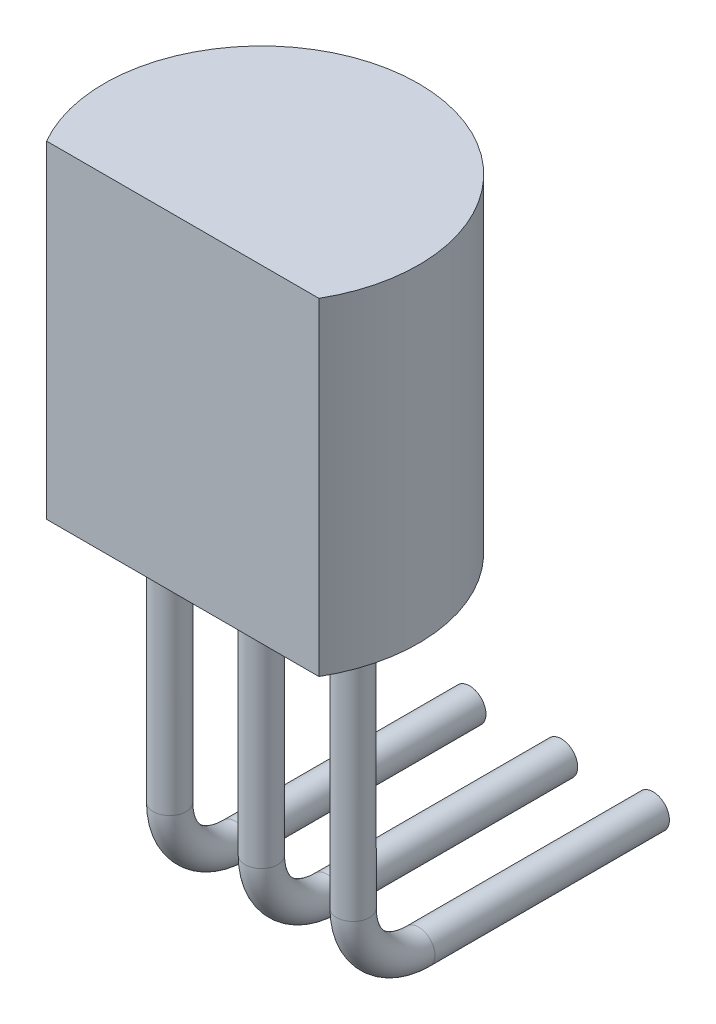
ISO-10303-21;
HEADER;
FILE_DESCRIPTION(('STEP AP214'),'2;1');
FILE_NAME('part.step','',(''),(''),'','','');
FILE_SCHEMA(('AUTOMOTIVE_DESIGN { 1 0 10303 214 1 1 1 1 }'));
ENDSEC;
DATA;
#1=APPLICATION_CONTEXT('core data for automotive mechanical design processes');
#2=APPLICATION_PROTOCOL_DEFINITION('international standard','automotive_design',2000,#1);
#3=PRODUCT_CONTEXT('',#1,'mechanical');
#4=PRODUCT('Part','Part','',(#3));
#5=PRODUCT_RELATED_PRODUCT_CATEGORY('part','',(#4));
#6=PRODUCT_DEFINITION_FORMATION('','',#4);
#7=PRODUCT_DEFINITION_CONTEXT('part definition',#1,'design');
#8=PRODUCT_DEFINITION('design','',#6,#7);
#9=PRODUCT_DEFINITION_SHAPE('','',#8);
#10=(LENGTH_UNIT() NAMED_UNIT(*) SI_UNIT(.MILLI.,.METRE.));
#11=(NAMED_UNIT(*) PLANE_ANGLE_UNIT() SI_UNIT($,.RADIAN.));
#12=(NAMED_UNIT(*) SI_UNIT($,.STERADIAN.) SOLID_ANGLE_UNIT());
#13=UNCERTAINTY_MEASURE_WITH_UNIT(LENGTH_MEASURE(1.E-05),#10,'distance_accuracy_value','');
#14=(GEOMETRIC_REPRESENTATION_CONTEXT(3) GLOBAL_UNCERTAINTY_ASSIGNED_CONTEXT((#13)) GLOBAL_UNIT_ASSIGNED_CONTEXT((#10,
#11,#12)) REPRESENTATION_CONTEXT('',''));
#15=CARTESIAN_POINT('',(0.,0.,0.));
#16=DIRECTION('',(0.,0.,1.));
#17=DIRECTION('',(1.,0.,0.));
#18=AXIS2_PLACEMENT_3D('',#15,#16,#17);
#19=CARTESIAN_POINT('',(0.,0.,0.));
#20=DIRECTION('',(0.,1.,0.));
#21=DIRECTION('',(0.,0.,1.));
#22=AXIS2_PLACEMENT_3D('',#19,#20,#21);
#23=PLANE('',#22);
#24=CARTESIAN_POINT('',(1.4,0.,0.));
#25=DIRECTION('',(0.,-1.,0.));
#26=DIRECTION('',(0.,0.,-1.));
#27=AXIS2_PLACEMENT_3D('',#24,#25,#26);
#28=CIRCLE('',#27,0.25);
#29=CARTESIAN_POINT('',(1.4,0.,-0.250000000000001));
#30=VERTEX_POINT('',#29);
#31=EDGE_CURVE('E42',#30,#30,#28,.T.);
#32=ORIENTED_EDGE('',*,*,#31,.F.);
#33=EDGE_LOOP('',(#32));
#34=FACE_BOUND('',#33,.T.);
#35=CARTESIAN_POINT('',(0.,0.,0.));
#36=DIRECTION('',(0.,1.,0.));
#37=DIRECTION('',(0.,0.,1.));
#38=AXIS2_PLACEMENT_3D('',#35,#36,#37);
#39=CIRCLE('',#38,2.4);
#40=CARTESIAN_POINT('',(2.07846096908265,0.,1.2));
#41=VERTEX_POINT('',#40);
#42=CARTESIAN_POINT('',(-2.07846096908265,0.,1.2));
#43=VERTEX_POINT('',#42);
#44=EDGE_CURVE('E64',#41,#43,#39,.T.);
#45=ORIENTED_EDGE('',*,*,#44,.F.);
#46=DIRECTION('',(1.,0.,0.));
#47=VECTOR('',#46,1.);
#48=CARTESIAN_POINT('',(-2.07846096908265,0.,1.2));
#49=LINE('',#48,#47);
#50=EDGE_CURVE('E61',#43,#41,#49,.T.);
#51=ORIENTED_EDGE('',*,*,#50,.F.);
#52=EDGE_LOOP('',(#45,#51));
#53=FACE_BOUND('',#52,.T.);
#54=CARTESIAN_POINT('',(0.,0.,0.));
#55=DIRECTION('',(0.,-1.,0.));
#56=DIRECTION('',(0.,0.,-1.));
#57=AXIS2_PLACEMENT_3D('',#54,#55,#56);
#58=CIRCLE('',#57,0.25);
#59=CARTESIAN_POINT('',(0.,0.,-0.25));
#60=VERTEX_POINT('',#59);
#61=EDGE_CURVE('E72',#60,#60,#58,.T.);
#62=ORIENTED_EDGE('',*,*,#61,.F.);
#63=EDGE_LOOP('',(#62));
#64=FACE_BOUND('',#63,.T.);
#65=CARTESIAN_POINT('',(-1.4,0.,0.));
#66=DIRECTION('',(0.,-1.,0.));
#67=DIRECTION('',(0.,0.,-1.));
#68=AXIS2_PLACEMENT_3D('',#65,#66,#67);
#69=CIRCLE('',#68,0.25);
#70=CARTESIAN_POINT('',(-1.4,0.,-0.250000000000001));
#71=VERTEX_POINT('',#70);
#72=EDGE_CURVE('E11',#71,#71,#69,.T.);
#73=ORIENTED_EDGE('',*,*,#72,.F.);
#74=EDGE_LOOP('',(#73));
#75=FACE_BOUND('',#74,.T.);
#76=ADVANCED_FACE('F33',(#34,#53,#64,#75),#23,.F.);
#77=CARTESIAN_POINT('',(0.,5.,0.));
#78=DIRECTION('',(0.,-1.,0.));
#79=DIRECTION('',(0.,0.,-1.));
#80=AXIS2_PLACEMENT_3D('',#77,#78,#79);
#81=CYLINDRICAL_SURFACE('',#80,2.4);
#82=ORIENTED_EDGE('',*,*,#44,.T.);
#83=DIRECTION('',(0.,-1.,0.));
#84=VECTOR('',#83,1.);
#85=CARTESIAN_POINT('',(-2.07846096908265,5.,1.2));
#86=LINE('',#85,#84);
#87=CARTESIAN_POINT('',(-2.07846096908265,5.,1.2));
#88=VERTEX_POINT('',#87);
#89=EDGE_CURVE('E37',#88,#43,#86,.T.);
#90=ORIENTED_EDGE('',*,*,#89,.F.);
#91=CARTESIAN_POINT('',(0.,5.,0.));
#92=DIRECTION('',(0.,1.,0.));
#93=DIRECTION('',(0.,0.,1.));
#94=AXIS2_PLACEMENT_3D('',#91,#92,#93);
#95=CIRCLE('',#94,2.4);
#96=CARTESIAN_POINT('',(2.07846096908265,5.,1.2));
#97=VERTEX_POINT('',#96);
#98=EDGE_CURVE('E66',#97,#88,#95,.T.);
#99=ORIENTED_EDGE('',*,*,#98,.F.);
#100=DIRECTION('',(0.,-1.,0.));
#101=VECTOR('',#100,1.);
#102=CARTESIAN_POINT('',(2.07846096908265,5.,1.2));
#103=LINE('',#102,#101);
#104=EDGE_CURVE('E73',#97,#41,#103,.T.);
#105=ORIENTED_EDGE('',*,*,#104,.T.);
#106=EDGE_LOOP('',(#82,#90,#99,#105));
#107=FACE_BOUND('',#106,.T.);
#108=ADVANCED_FACE('F35',(#107),#81,.T.);
#109=CARTESIAN_POINT('',(-2.07846096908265,5.,1.2));
#110=DIRECTION('',(0.,0.,-1.));
#111=DIRECTION('',(-1.,0.,0.));
#112=AXIS2_PLACEMENT_3D('',#109,#110,#111);
#113=PLANE('',#112);
#114=ORIENTED_EDGE('',*,*,#50,.T.);
#115=ORIENTED_EDGE('',*,*,#104,.F.);
#116=DIRECTION('',(1.,0.,0.));
#117=VECTOR('',#116,1.);
#118=CARTESIAN_POINT('',(-2.07846096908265,5.,1.2));
#119=LINE('',#118,#117);
#120=EDGE_CURVE('E49',#88,#97,#119,.T.);
#121=ORIENTED_EDGE('',*,*,#120,.F.);
#122=ORIENTED_EDGE('',*,*,#89,.T.);
#123=EDGE_LOOP('',(#114,#115,#121,#122));
#124=FACE_BOUND('',#123,.T.);
#125=ADVANCED_FACE('F69',(#124),#113,.F.);
#126=CARTESIAN_POINT('',(0.,5.,0.));
#127=DIRECTION('',(0.,1.,0.));
#128=DIRECTION('',(0.,0.,1.));
#129=AXIS2_PLACEMENT_3D('',#126,#127,#128);
#130=PLANE('',#129);
#131=ORIENTED_EDGE('',*,*,#98,.T.);
#132=ORIENTED_EDGE('',*,*,#120,.T.);
#133=EDGE_LOOP('',(#131,#132));
#134=FACE_BOUND('',#133,.T.);
#135=ADVANCED_FACE('F82',(#134),#130,.T.);
#136=CARTESIAN_POINT('',(0.,-5.,-1.00000000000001));
#137=DIRECTION('',(0.,0.,-1.));
#138=DIRECTION('',(-1.,0.,0.));
#139=AXIS2_PLACEMENT_3D('',#136,#137,#138);
#140=CYLINDRICAL_SURFACE('',#139,0.25);
#141=CARTESIAN_POINT('',(0.,-5.,-1.00000000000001));
#142=DIRECTION('',(0.,0.,-1.));
#143=DIRECTION('',(0.,1.,0.));
#144=AXIS2_PLACEMENT_3D('',#141,#142,#143);
#145=CIRCLE('',#144,0.25);
#146=CARTESIAN_POINT('',(0.,-5.25,-1.00000000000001));
#147=VERTEX_POINT('',#146);
#148=EDGE_CURVE('E77',#147,#147,#145,.T.);
#149=ORIENTED_EDGE('',*,*,#148,.T.);
#150=EDGE_LOOP('',(#149));
#151=FACE_BOUND('',#150,.T.);
#152=CARTESIAN_POINT('',(0.,-5.,-4.57813022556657));
#153=DIRECTION('',(0.,0.,-1.));
#154=DIRECTION('',(0.,1.,0.));
#155=AXIS2_PLACEMENT_3D('',#152,#153,#154);
#156=CIRCLE('',#155,0.25);
#157=CARTESIAN_POINT('',(0.,-4.75,-4.57813022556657));
#158=VERTEX_POINT('',#157);
#159=EDGE_CURVE('E74',#158,#158,#156,.T.);
#160=ORIENTED_EDGE('',*,*,#159,.F.);
#161=EDGE_LOOP('',(#160));
#162=FACE_BOUND('',#161,.T.);
#163=ADVANCED_FACE('F84',(#151,#162),#140,.T.);
#164=CARTESIAN_POINT('',(0.,-4.,-1.));
#165=DIRECTION('',(1.,0.,0.));
#166=DIRECTION('',(0.,0.,-1.));
#167=AXIS2_PLACEMENT_3D('',#164,#165,#166);
#168=TOROIDAL_SURFACE('',#167,1.,0.25);
#169=CARTESIAN_POINT('',(0.,-3.99999999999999,0.));
#170=DIRECTION('',(0.,-1.,0.));
#171=DIRECTION('',(0.,0.,-1.));
#172=AXIS2_PLACEMENT_3D('',#169,#170,#171);
#173=CIRCLE('',#172,0.25);
#174=CARTESIAN_POINT('',(0.,-3.99999999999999,0.25));
#175=VERTEX_POINT('',#174);
#176=EDGE_CURVE('E167',#175,#175,#173,.T.);
#177=CARTESIAN_POINT('',(0.,-4.,-1.));
#178=DIRECTION('',(1.,0.,0.));
#179=DIRECTION('',(0.,0.,-1.));
#180=AXIS2_PLACEMENT_3D('',#177,#178,#179);
#181=CIRCLE('',#180,1.25);
#182=EDGE_CURVE('',#175,#147,#181,.T.);
#183=ORIENTED_EDGE('',*,*,#176,.T.);
#184=ORIENTED_EDGE('',*,*,#148,.F.);
#185=ORIENTED_EDGE('',*,*,#182,.T.);
#186=ORIENTED_EDGE('',*,*,#182,.F.);
#187=EDGE_LOOP('',(#183,#185,#184,#186));
#188=FACE_BOUND('',#187,.T.);
#189=ADVANCED_FACE('F90',(#188),#168,.T.);
#190=CARTESIAN_POINT('',(0.,-3.99999999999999,0.));
#191=DIRECTION('',(0.,1.,0.));
#192=DIRECTION('',(0.,0.,1.));
#193=AXIS2_PLACEMENT_3D('',#190,#191,#192);
#194=CYLINDRICAL_SURFACE('',#193,0.25);
#195=ORIENTED_EDGE('',*,*,#176,.F.);
#196=EDGE_LOOP('',(#195));
#197=FACE_BOUND('',#196,.T.);
#198=ORIENTED_EDGE('',*,*,#61,.T.);
#199=EDGE_LOOP('',(#198));
#200=FACE_BOUND('',#199,.T.);
#201=ADVANCED_FACE('F103',(#197,#200),#194,.T.);
#202=CARTESIAN_POINT('',(0.,-5.,-4.57813022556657));
#203=DIRECTION('',(0.,0.,-1.));
#204=DIRECTION('',(0.,1.,0.));
#205=AXIS2_PLACEMENT_3D('',#202,#203,#204);
#206=PLANE('',#205);
#207=ORIENTED_EDGE('',*,*,#159,.T.);
#208=EDGE_LOOP('',(#207));
#209=FACE_BOUND('',#208,.T.);
#210=ADVANCED_FACE('F107',(#209),#206,.T.);
#211=CARTESIAN_POINT('',(1.4,-5.,-1.00000000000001));
#212=DIRECTION('',(0.,0.,-1.));
#213=DIRECTION('',(-1.,0.,0.));
#214=AXIS2_PLACEMENT_3D('',#211,#212,#213);
#215=CYLINDRICAL_SURFACE('',#214,0.25);
#216=CARTESIAN_POINT('',(1.4,-5.,-1.00000000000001));
#217=DIRECTION('',(0.,0.,-1.));
#218=DIRECTION('',(0.,1.,0.));
#219=AXIS2_PLACEMENT_3D('',#216,#217,#218);
#220=CIRCLE('',#219,0.25);
#221=CARTESIAN_POINT('',(1.4,-5.25,-1.00000000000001));
#222=VERTEX_POINT('',#221);
#223=EDGE_CURVE('E153',#222,#222,#220,.T.);
#224=ORIENTED_EDGE('',*,*,#223,.T.);
#225=EDGE_LOOP('',(#224));
#226=FACE_BOUND('',#225,.T.);
#227=CARTESIAN_POINT('',(1.4,-5.,-4.57813022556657));
#228=DIRECTION('',(0.,0.,-1.));
#229=DIRECTION('',(0.,1.,0.));
#230=AXIS2_PLACEMENT_3D('',#227,#228,#229);
#231=CIRCLE('',#230,0.25);
#232=CARTESIAN_POINT('',(1.4,-4.75,-4.57813022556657));
#233=VERTEX_POINT('',#232);
#234=EDGE_CURVE('E164',#233,#233,#231,.T.);
#235=ORIENTED_EDGE('',*,*,#234,.F.);
#236=EDGE_LOOP('',(#235));
#237=FACE_BOUND('',#236,.T.);
#238=ADVANCED_FACE('F111',(#226,#237),#215,.T.);
#239=CARTESIAN_POINT('',(1.4,-4.,-1.));
#240=DIRECTION('',(1.,0.,0.));
#241=DIRECTION('',(0.,0.,-1.));
#242=AXIS2_PLACEMENT_3D('',#239,#240,#241);
#243=TOROIDAL_SURFACE('',#242,0.999999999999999,0.25);
#244=CARTESIAN_POINT('',(1.4,-3.99999999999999,0.));
#245=DIRECTION('',(0.,-1.,0.));
#246=DIRECTION('',(0.,0.,-1.));
#247=AXIS2_PLACEMENT_3D('',#244,#245,#246);
#248=CIRCLE('',#247,0.25);
#249=CARTESIAN_POINT('',(1.4,-3.99999999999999,0.249999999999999));
#250=VERTEX_POINT('',#249);
#251=EDGE_CURVE('E149',#250,#250,#248,.T.);
#252=CARTESIAN_POINT('',(1.4,-4.,-1.));
#253=DIRECTION('',(1.,0.,0.));
#254=DIRECTION('',(0.,0.,-1.));
#255=AXIS2_PLACEMENT_3D('',#252,#253,#254);
#256=CIRCLE('',#255,1.25);
#257=EDGE_CURVE('',#250,#222,#256,.T.);
#258=ORIENTED_EDGE('',*,*,#251,.T.);
#259=ORIENTED_EDGE('',*,*,#223,.F.);
#260=ORIENTED_EDGE('',*,*,#257,.T.);
#261=ORIENTED_EDGE('',*,*,#257,.F.);
#262=EDGE_LOOP('',(#258,#260,#259,#261));
#263=FACE_BOUND('',#262,.T.);
#264=ADVANCED_FACE('F115',(#263),#243,.T.);
#265=CARTESIAN_POINT('',(1.4,-3.99999999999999,0.));
#266=DIRECTION('',(0.,1.,0.));
#267=DIRECTION('',(0.,0.,1.));
#268=AXIS2_PLACEMENT_3D('',#265,#266,#267);
#269=CYLINDRICAL_SURFACE('',#268,0.25);
#270=ORIENTED_EDGE('',*,*,#251,.F.);
#271=EDGE_LOOP('',(#270));
#272=FACE_BOUND('',#271,.T.);
#273=ORIENTED_EDGE('',*,*,#31,.T.);
#274=EDGE_LOOP('',(#273));
#275=FACE_BOUND('',#274,.T.);
#276=ADVANCED_FACE('F119',(#272,#275),#269,.T.);
#277=CARTESIAN_POINT('',(1.4,-5.,-4.57813022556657));
#278=DIRECTION('',(0.,0.,-1.));
#279=DIRECTION('',(0.,1.,0.));
#280=AXIS2_PLACEMENT_3D('',#277,#278,#279);
#281=PLANE('',#280);
#282=ORIENTED_EDGE('',*,*,#234,.T.);
#283=EDGE_LOOP('',(#282));
#284=FACE_BOUND('',#283,.T.);
#285=ADVANCED_FACE('F123',(#284),#281,.T.);
#286=CARTESIAN_POINT('',(-1.4,-5.,-1.00000000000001));
#287=DIRECTION('',(0.,0.,-1.));
#288=DIRECTION('',(-1.,0.,0.));
#289=AXIS2_PLACEMENT_3D('',#286,#287,#288);
#290=CYLINDRICAL_SURFACE('',#289,0.25);
#291=CARTESIAN_POINT('',(-1.4,-5.,-1.00000000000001));
#292=DIRECTION('',(0.,0.,-1.));
#293=DIRECTION('',(0.,1.,0.));
#294=AXIS2_PLACEMENT_3D('',#291,#292,#293);
#295=CIRCLE('',#294,0.25);
#296=CARTESIAN_POINT('',(-1.4,-5.25,-1.00000000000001));
#297=VERTEX_POINT('',#296);
#298=EDGE_CURVE('E150',#297,#297,#295,.T.);
#299=ORIENTED_EDGE('',*,*,#298,.T.);
#300=EDGE_LOOP('',(#299));
#301=FACE_BOUND('',#300,.T.);
#302=CARTESIAN_POINT('',(-1.4,-5.,-4.57813022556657));
#303=DIRECTION('',(0.,0.,-1.));
#304=DIRECTION('',(0.,1.,0.));
#305=AXIS2_PLACEMENT_3D('',#302,#303,#304);
#306=CIRCLE('',#305,0.25);
#307=CARTESIAN_POINT('',(-1.4,-4.75,-4.57813022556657));
#308=VERTEX_POINT('',#307);
#309=EDGE_CURVE('E147',#308,#308,#306,.T.);
#310=ORIENTED_EDGE('',*,*,#309,.F.);
#311=EDGE_LOOP('',(#310));
#312=FACE_BOUND('',#311,.T.);
#313=ADVANCED_FACE('F127',(#301,#312),#290,.T.);
#314=CARTESIAN_POINT('',(-1.4,-4.,-1.));
#315=DIRECTION('',(1.,0.,0.));
#316=DIRECTION('',(0.,0.,-1.));
#317=AXIS2_PLACEMENT_3D('',#314,#315,#316);
#318=TOROIDAL_SURFACE('',#317,0.999999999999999,0.25);
#319=CARTESIAN_POINT('',(-1.4,-3.99999999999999,0.));
#320=DIRECTION('',(0.,-1.,0.));
#321=DIRECTION('',(0.,0.,-1.));
#322=AXIS2_PLACEMENT_3D('',#319,#320,#321);
#323=CIRCLE('',#322,0.25);
#324=CARTESIAN_POINT('',(-1.4,-3.99999999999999,0.249999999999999));
#325=VERTEX_POINT('',#324);
#326=EDGE_CURVE('E156',#325,#325,#323,.T.);
#327=CARTESIAN_POINT('',(-1.4,-4.,-1.));
#328=DIRECTION('',(1.,0.,0.));
#329=DIRECTION('',(0.,0.,-1.));
#330=AXIS2_PLACEMENT_3D('',#327,#328,#329);
#331=CIRCLE('',#330,1.25);
#332=EDGE_CURVE('',#325,#297,#331,.T.);
#333=ORIENTED_EDGE('',*,*,#326,.T.);
#334=ORIENTED_EDGE('',*,*,#298,.F.);
#335=ORIENTED_EDGE('',*,*,#332,.T.);
#336=ORIENTED_EDGE('',*,*,#332,.F.);
#337=EDGE_LOOP('',(#333,#335,#334,#336));
#338=FACE_BOUND('',#337,.T.);
#339=ADVANCED_FACE('F131',(#338),#318,.T.);
#340=CARTESIAN_POINT('',(-1.4,-3.99999999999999,0.));
#341=DIRECTION('',(0.,1.,0.));
#342=DIRECTION('',(0.,0.,1.));
#343=AXIS2_PLACEMENT_3D('',#340,#341,#342);
#344=CYLINDRICAL_SURFACE('',#343,0.25);
#345=ORIENTED_EDGE('',*,*,#326,.F.);
#346=EDGE_LOOP('',(#345));
#347=FACE_BOUND('',#346,.T.);
#348=ORIENTED_EDGE('',*,*,#72,.T.);
#349=EDGE_LOOP('',(#348));
#350=FACE_BOUND('',#349,.T.);
#351=ADVANCED_FACE('F135',(#347,#350),#344,.T.);
#352=CARTESIAN_POINT('',(-1.4,-5.,-4.57813022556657));
#353=DIRECTION('',(0.,0.,-1.));
#354=DIRECTION('',(0.,1.,0.));
#355=AXIS2_PLACEMENT_3D('',#352,#353,#354);
#356=PLANE('',#355);
#357=ORIENTED_EDGE('',*,*,#309,.T.);
#358=EDGE_LOOP('',(#357));
#359=FACE_BOUND('',#358,.T.);
#360=ADVANCED_FACE('F139',(#359),#356,.T.);
#361=CLOSED_SHELL('',(#76,#108,#125,#135,#163,#189,#201,#210,#238,#264,#276,#285,#313,#339,#351,#360));
#362=MANIFOLD_SOLID_BREP('B2',#361);
#363=ADVANCED_BREP_SHAPE_REPRESENTATION('',(#18,#362),#14);
#364=SHAPE_DEFINITION_REPRESENTATION(#9,#363);
ENDSEC;
END-ISO-10303-21;
